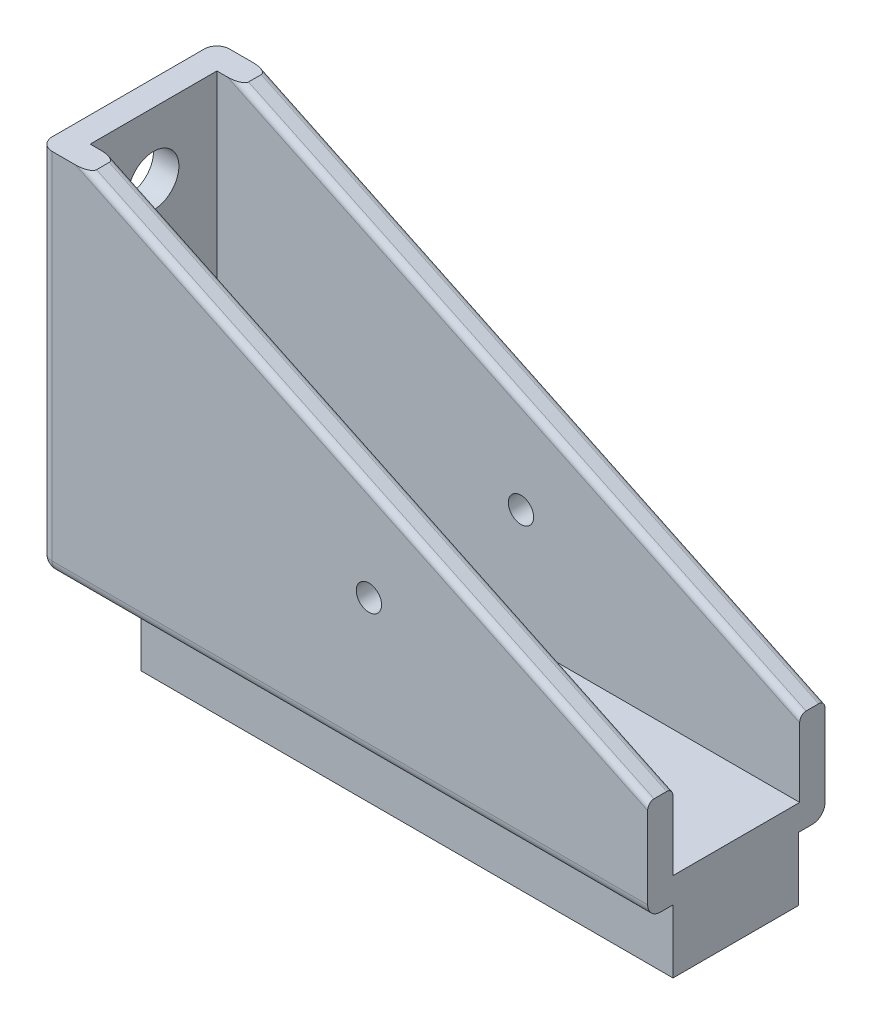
ISO-10303-21;
HEADER;
FILE_DESCRIPTION(('STEP AP214'),'2;1');
FILE_NAME('part.step','',(''),(''),'','','');
FILE_SCHEMA(('AUTOMOTIVE_DESIGN { 1 0 10303 214 1 1 1 1 }'));
ENDSEC;
DATA;
#1=APPLICATION_CONTEXT('core data for automotive mechanical design processes');
#2=APPLICATION_PROTOCOL_DEFINITION('international standard','automotive_design',2000,#1);
#3=PRODUCT_CONTEXT('',#1,'mechanical');
#4=PRODUCT('Part','Part','',(#3));
#5=PRODUCT_RELATED_PRODUCT_CATEGORY('part','',(#4));
#6=PRODUCT_DEFINITION_FORMATION('','',#4);
#7=PRODUCT_DEFINITION_CONTEXT('part definition',#1,'design');
#8=PRODUCT_DEFINITION('design','',#6,#7);
#9=PRODUCT_DEFINITION_SHAPE('','',#8);
#10=(LENGTH_UNIT() NAMED_UNIT(*) SI_UNIT(.MILLI.,.METRE.));
#11=(NAMED_UNIT(*) PLANE_ANGLE_UNIT() SI_UNIT($,.RADIAN.));
#12=(NAMED_UNIT(*) SI_UNIT($,.STERADIAN.) SOLID_ANGLE_UNIT());
#13=UNCERTAINTY_MEASURE_WITH_UNIT(LENGTH_MEASURE(1.E-05),#10,'distance_accuracy_value','');
#14=(GEOMETRIC_REPRESENTATION_CONTEXT(3) GLOBAL_UNCERTAINTY_ASSIGNED_CONTEXT((#13)) GLOBAL_UNIT_ASSIGNED_CONTEXT((#10,
#11,#12)) REPRESENTATION_CONTEXT('',''));
#15=CARTESIAN_POINT('',(0.,0.,0.));
#16=DIRECTION('',(0.,0.,1.));
#17=DIRECTION('',(1.,0.,0.));
#18=AXIS2_PLACEMENT_3D('',#15,#16,#17);
#19=CARTESIAN_POINT('',(-45.3827683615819,3.08601694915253,-14.));
#20=DIRECTION('',(0.,-1.,0.));
#21=DIRECTION('',(0.,0.,-1.));
#22=AXIS2_PLACEMENT_3D('',#19,#20,#21);
#23=PLANE('',#22);
#24=DIRECTION('',(1.,0.,0.));
#25=VECTOR('',#24,1.);
#26=CARTESIAN_POINT('',(-45.3827683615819,3.08601694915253,-1.));
#27=LINE('',#26,#25);
#28=CARTESIAN_POINT('',(2.61723163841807,3.08601694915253,-0.999999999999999));
#29=VERTEX_POINT('',#28);
#30=CARTESIAN_POINT('',(-44.3827683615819,3.08601694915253,-1.));
#31=VERTEX_POINT('',#30);
#32=EDGE_CURVE('E295',#29,#31,#27,.F.);
#33=ORIENTED_EDGE('',*,*,#32,.T.);
#34=DIRECTION('',(0.,0.,1.));
#35=VECTOR('',#34,1.);
#36=CARTESIAN_POINT('',(-44.3827683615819,3.08601694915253,-14.));
#37=LINE('',#36,#35);
#38=CARTESIAN_POINT('',(-44.3827683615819,3.08601694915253,-13.));
#39=VERTEX_POINT('',#38);
#40=EDGE_CURVE('E359',#31,#39,#37,.F.);
#41=ORIENTED_EDGE('',*,*,#40,.T.);
#42=DIRECTION('',(1.,0.,0.));
#43=VECTOR('',#42,1.);
#44=CARTESIAN_POINT('',(-45.3827683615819,3.08601694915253,-13.));
#45=LINE('',#44,#43);
#46=CARTESIAN_POINT('',(2.61723163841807,3.08601694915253,-13.));
#47=VERTEX_POINT('',#46);
#48=EDGE_CURVE('E297',#39,#47,#45,.T.);
#49=ORIENTED_EDGE('',*,*,#48,.T.);
#50=DIRECTION('',(0.,0.,1.));
#51=VECTOR('',#50,1.);
#52=CARTESIAN_POINT('',(2.61723163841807,3.08601694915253,-14.));
#53=LINE('',#52,#51);
#54=CARTESIAN_POINT('',(2.61723163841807,3.08601694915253,-11.9065683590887));
#55=VERTEX_POINT('',#54);
#56=EDGE_CURVE('E211',#47,#55,#53,.T.);
#57=ORIENTED_EDGE('',*,*,#56,.T.);
#58=DIRECTION('',(1.,0.,0.));
#59=VECTOR('',#58,1.);
#60=CARTESIAN_POINT('',(-39.3827683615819,3.08601694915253,-11.9065683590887));
#61=LINE('',#60,#59);
#62=CARTESIAN_POINT('',(-39.3827683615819,3.08601694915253,-11.9065683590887));
#63=VERTEX_POINT('',#62);
#64=EDGE_CURVE('E208',#63,#55,#61,.T.);
#65=ORIENTED_EDGE('',*,*,#64,.F.);
#66=DIRECTION('',(0.,0.,-1.));
#67=VECTOR('',#66,1.);
#68=CARTESIAN_POINT('',(-39.3827683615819,3.08601694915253,-12.));
#69=LINE('',#68,#67);
#70=CARTESIAN_POINT('',(-39.3827683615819,3.08601694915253,-12.));
#71=VERTEX_POINT('',#70);
#72=EDGE_CURVE('E193',#63,#71,#69,.T.);
#73=ORIENTED_EDGE('',*,*,#72,.T.);
#74=DIRECTION('',(-1.,0.,0.));
#75=VECTOR('',#74,1.);
#76=CARTESIAN_POINT('',(-43.3827683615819,3.08601694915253,-12.));
#77=LINE('',#76,#75);
#78=CARTESIAN_POINT('',(-43.3827683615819,3.08601694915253,-12.));
#79=VERTEX_POINT('',#78);
#80=EDGE_CURVE('E204',#71,#79,#77,.T.);
#81=ORIENTED_EDGE('',*,*,#80,.T.);
#82=DIRECTION('',(0.,0.,1.));
#83=VECTOR('',#82,1.);
#84=CARTESIAN_POINT('',(-43.3827683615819,3.08601694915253,-12.));
#85=LINE('',#84,#83);
#86=CARTESIAN_POINT('',(-43.3827683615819,3.08601694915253,-2.));
#87=VERTEX_POINT('',#86);
#88=EDGE_CURVE('E237',#79,#87,#85,.T.);
#89=ORIENTED_EDGE('',*,*,#88,.T.);
#90=DIRECTION('',(1.,0.,0.));
#91=VECTOR('',#90,1.);
#92=CARTESIAN_POINT('',(-43.3827683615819,3.08601694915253,-2.));
#93=LINE('',#92,#91);
#94=CARTESIAN_POINT('',(-39.3827683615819,3.08601694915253,-2.));
#95=VERTEX_POINT('',#94);
#96=EDGE_CURVE('E205',#87,#95,#93,.T.);
#97=ORIENTED_EDGE('',*,*,#96,.T.);
#98=DIRECTION('',(-1.,0.,0.));
#99=VECTOR('',#98,1.);
#100=CARTESIAN_POINT('',(-39.3827683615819,3.08601694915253,-2.));
#101=LINE('',#100,#99);
#102=CARTESIAN_POINT('',(2.61723163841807,3.08601694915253,-2.));
#103=VERTEX_POINT('',#102);
#104=EDGE_CURVE('E215',#103,#95,#101,.T.);
#105=ORIENTED_EDGE('',*,*,#104,.F.);
#106=EDGE_CURVE('E293',#103,#29,#53,.T.);
#107=ORIENTED_EDGE('',*,*,#106,.T.);
#108=EDGE_LOOP('',(#33,#41,#49,#57,#65,#73,#81,#89,#97,#105,#107));
#109=FACE_BOUND('',#108,.T.);
#110=ADVANCED_FACE('F34',(#109),#23,.T.);
#111=CARTESIAN_POINT('',(2.61723163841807,11.0860169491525,-14.));
#112=DIRECTION('',(0.430729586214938,0.90248103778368,0.));
#113=DIRECTION('',(-0.90248103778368,0.430729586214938,0.));
#114=AXIS2_PLACEMENT_3D('',#111,#112,#113);
#115=PLANE('',#114);
#116=DIRECTION('',(0.,0.,1.));
#117=VECTOR('',#116,1.);
#118=CARTESIAN_POINT('',(2.61723163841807,11.0860169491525,-14.));
#119=LINE('',#118,#117);
#120=CARTESIAN_POINT('',(2.61723163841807,11.0860169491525,-13.5));
#121=VERTEX_POINT('',#120);
#122=CARTESIAN_POINT('',(2.61723163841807,11.0860169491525,-12.5));
#123=VERTEX_POINT('',#122);
#124=EDGE_CURVE('E288',#121,#123,#119,.T.);
#125=ORIENTED_EDGE('',*,*,#124,.F.);
#126=DIRECTION('',(-0.90248103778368,0.430729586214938,0.));
#127=VECTOR('',#126,1.);
#128=CARTESIAN_POINT('',(2.61723163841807,11.0860169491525,-13.5));
#129=LINE('',#128,#127);
#130=CARTESIAN_POINT('',(-41.3827683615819,32.0860169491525,-13.5));
#131=VERTEX_POINT('',#130);
#132=EDGE_CURVE('E310',#121,#131,#129,.T.);
#133=ORIENTED_EDGE('',*,*,#132,.T.);
#134=DIRECTION('',(0.,0.,1.));
#135=VECTOR('',#134,1.);
#136=CARTESIAN_POINT('',(-41.3827683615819,32.0860169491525,-14.));
#137=LINE('',#136,#135);
#138=CARTESIAN_POINT('',(-41.3827683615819,32.0860169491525,-12.5));
#139=VERTEX_POINT('',#138);
#140=EDGE_CURVE('E287',#131,#139,#137,.T.);
#141=ORIENTED_EDGE('',*,*,#140,.T.);
#142=DIRECTION('',(-0.90248103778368,0.430729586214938,0.));
#143=VECTOR('',#142,1.);
#144=CARTESIAN_POINT('',(2.61723163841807,11.0860169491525,-12.5));
#145=LINE('',#144,#143);
#146=EDGE_CURVE('E308',#139,#123,#145,.F.);
#147=ORIENTED_EDGE('',*,*,#146,.T.);
#148=EDGE_LOOP('',(#125,#133,#141,#147));
#149=FACE_BOUND('',#148,.T.);
#150=ADVANCED_FACE('F453',(#149),#115,.T.);
#151=CARTESIAN_POINT('',(-41.3827683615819,32.0860169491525,-14.));
#152=DIRECTION('',(0.,1.,0.));
#153=DIRECTION('',(0.,0.,1.));
#154=AXIS2_PLACEMENT_3D('',#151,#152,#153);
#155=PLANE('',#154);
#156=DIRECTION('',(0.,0.,1.));
#157=VECTOR('',#156,1.);
#158=CARTESIAN_POINT('',(-45.3827683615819,32.0860169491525,-14.));
#159=LINE('',#158,#157);
#160=CARTESIAN_POINT('',(-45.3827683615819,32.0860169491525,-13.));
#161=VERTEX_POINT('',#160);
#162=CARTESIAN_POINT('',(-45.3827683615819,32.0860169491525,-0.999999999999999));
#163=VERTEX_POINT('',#162);
#164=EDGE_CURVE('E283',#161,#163,#159,.T.);
#165=ORIENTED_EDGE('',*,*,#164,.T.);
#166=CARTESIAN_POINT('',(-44.3827683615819,32.0860169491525,-1.));
#167=DIRECTION('',(0.,1.,0.));
#168=DIRECTION('',(0.,0.,1.));
#169=AXIS2_PLACEMENT_3D('',#166,#167,#168);
#170=CIRCLE('',#169,1.);
#171=CARTESIAN_POINT('',(-44.3827683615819,32.0860169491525,0.));
#172=VERTEX_POINT('',#171);
#173=EDGE_CURVE('E42',#163,#172,#170,.T.);
#174=ORIENTED_EDGE('',*,*,#173,.T.);
#175=DIRECTION('',(-1.,0.,0.));
#176=VECTOR('',#175,1.);
#177=CARTESIAN_POINT('',(-41.3827683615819,32.0860169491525,0.));
#178=LINE('',#177,#176);
#179=CARTESIAN_POINT('',(-42.5435894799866,32.0860169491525,0.));
#180=VERTEX_POINT('',#179);
#181=EDGE_CURVE('E266',#180,#172,#178,.T.);
#182=ORIENTED_EDGE('',*,*,#181,.F.);
#183=CARTESIAN_POINT('',(-42.5435894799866,32.0860169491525,-0.5));
#184=DIRECTION('',(0.,1.,0.));
#185=DIRECTION('',(1.,0.,0.));
#186=AXIS2_PLACEMENT_3D('',#183,#184,#185);
#187=ELLIPSE('',#186,1.16082111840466,0.5);
#188=CARTESIAN_POINT('',(-41.3827683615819,32.0860169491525,-0.5));
#189=VERTEX_POINT('',#188);
#190=EDGE_CURVE('E313',#180,#189,#187,.T.);
#191=ORIENTED_EDGE('',*,*,#190,.T.);
#192=CARTESIAN_POINT('',(-41.3827683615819,32.0860169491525,-1.5));
#193=VERTEX_POINT('',#192);
#194=EDGE_CURVE('E284',#193,#189,#137,.T.);
#195=ORIENTED_EDGE('',*,*,#194,.F.);
#196=CARTESIAN_POINT('',(-42.5435894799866,32.0860169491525,-1.5));
#197=DIRECTION('',(0.,1.,0.));
#198=DIRECTION('',(-1.,0.,0.));
#199=AXIS2_PLACEMENT_3D('',#196,#197,#198);
#200=ELLIPSE('',#199,1.16082111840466,0.5);
#201=CARTESIAN_POINT('',(-42.5435894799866,32.0860169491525,-2.));
#202=VERTEX_POINT('',#201);
#203=EDGE_CURVE('E315',#193,#202,#200,.T.);
#204=ORIENTED_EDGE('',*,*,#203,.T.);
#205=DIRECTION('',(1.,0.,0.));
#206=VECTOR('',#205,1.);
#207=CARTESIAN_POINT('',(-43.3827683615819,32.0860169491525,-2.));
#208=LINE('',#207,#206);
#209=CARTESIAN_POINT('',(-43.3827683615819,32.0860169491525,-2.));
#210=VERTEX_POINT('',#209);
#211=EDGE_CURVE('E251',#210,#202,#208,.T.);
#212=ORIENTED_EDGE('',*,*,#211,.F.);
#213=DIRECTION('',(0.,0.,1.));
#214=VECTOR('',#213,1.);
#215=CARTESIAN_POINT('',(-43.3827683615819,32.0860169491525,-2.));
#216=LINE('',#215,#214);
#217=CARTESIAN_POINT('',(-43.3827683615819,32.0860169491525,-12.));
#218=VERTEX_POINT('',#217);
#219=EDGE_CURVE('E248',#218,#210,#216,.T.);
#220=ORIENTED_EDGE('',*,*,#219,.F.);
#221=DIRECTION('',(-1.,0.,0.));
#222=VECTOR('',#221,1.);
#223=CARTESIAN_POINT('',(-43.3827683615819,32.0860169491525,-12.));
#224=LINE('',#223,#222);
#225=CARTESIAN_POINT('',(-42.5435894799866,32.0860169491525,-12.));
#226=VERTEX_POINT('',#225);
#227=EDGE_CURVE('E245',#226,#218,#224,.T.);
#228=ORIENTED_EDGE('',*,*,#227,.F.);
#229=CARTESIAN_POINT('',(-42.5435894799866,32.0860169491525,-12.5));
#230=DIRECTION('',(0.,1.,0.));
#231=DIRECTION('',(1.,0.,0.));
#232=AXIS2_PLACEMENT_3D('',#229,#230,#231);
#233=ELLIPSE('',#232,1.16082111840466,0.5);
#234=EDGE_CURVE('E317',#226,#139,#233,.T.);
#235=ORIENTED_EDGE('',*,*,#234,.T.);
#236=ORIENTED_EDGE('',*,*,#140,.F.);
#237=CARTESIAN_POINT('',(-42.5435894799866,32.0860169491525,-13.5));
#238=DIRECTION('',(0.,1.,0.));
#239=DIRECTION('',(-1.,0.,0.));
#240=AXIS2_PLACEMENT_3D('',#237,#238,#239);
#241=ELLIPSE('',#240,1.16082111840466,0.5);
#242=CARTESIAN_POINT('',(-42.5435894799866,32.0860169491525,-14.));
#243=VERTEX_POINT('',#242);
#244=EDGE_CURVE('E319',#131,#243,#241,.T.);
#245=ORIENTED_EDGE('',*,*,#244,.T.);
#246=DIRECTION('',(-1.,0.,0.));
#247=VECTOR('',#246,1.);
#248=CARTESIAN_POINT('',(-41.3827683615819,32.0860169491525,-14.));
#249=LINE('',#248,#247);
#250=CARTESIAN_POINT('',(-44.3827683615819,32.0860169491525,-14.));
#251=VERTEX_POINT('',#250);
#252=EDGE_CURVE('E278',#243,#251,#249,.T.);
#253=ORIENTED_EDGE('',*,*,#252,.T.);
#254=CARTESIAN_POINT('',(-44.3827683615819,32.0860169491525,-13.));
#255=DIRECTION('',(0.,1.,0.));
#256=DIRECTION('',(0.,0.,1.));
#257=AXIS2_PLACEMENT_3D('',#254,#255,#256);
#258=CIRCLE('',#257,1.);
#259=EDGE_CURVE('E367',#251,#161,#258,.T.);
#260=ORIENTED_EDGE('',*,*,#259,.T.);
#261=EDGE_LOOP('',(#165,#174,#182,#191,#195,#204,#212,#220,#228,#235,#236,#245,#253,#260));
#262=FACE_BOUND('',#261,.T.);
#263=ADVANCED_FACE('F36',(#262),#155,.T.);
#264=CARTESIAN_POINT('',(2.61723163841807,11.0860169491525,-1.5));
#265=VERTEX_POINT('',#264);
#266=CARTESIAN_POINT('',(2.61723163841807,11.0860169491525,-0.5));
#267=VERTEX_POINT('',#266);
#268=EDGE_CURVE('E289',#265,#267,#119,.T.);
#269=ORIENTED_EDGE('',*,*,#268,.F.);
#270=DIRECTION('',(0.90248103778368,-0.430729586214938,0.));
#271=VECTOR('',#270,1.);
#272=CARTESIAN_POINT('',(-41.3827683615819,32.0860169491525,-1.5));
#273=LINE('',#272,#271);
#274=EDGE_CURVE('E339',#265,#193,#273,.F.);
#275=ORIENTED_EDGE('',*,*,#274,.T.);
#276=ORIENTED_EDGE('',*,*,#194,.T.);
#277=DIRECTION('',(-0.90248103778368,0.430729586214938,0.));
#278=VECTOR('',#277,1.);
#279=CARTESIAN_POINT('',(2.61723163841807,11.0860169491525,-0.5));
#280=LINE('',#279,#278);
#281=EDGE_CURVE('E337',#189,#267,#280,.F.);
#282=ORIENTED_EDGE('',*,*,#281,.T.);
#283=EDGE_LOOP('',(#269,#275,#276,#282));
#284=FACE_BOUND('',#283,.T.);
#285=ADVANCED_FACE('F425',(#284),#115,.T.);
#286=CARTESIAN_POINT('',(2.61723163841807,3.08601694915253,-14.));
#287=DIRECTION('',(1.,0.,0.));
#288=DIRECTION('',(0.,0.,-1.));
#289=AXIS2_PLACEMENT_3D('',#286,#287,#288);
#290=PLANE('',#289);
#291=DIRECTION('',(0.,1.,0.));
#292=VECTOR('',#291,1.);
#293=CARTESIAN_POINT('',(2.61723163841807,3.08601694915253,-14.));
#294=LINE('',#293,#292);
#295=CARTESIAN_POINT('',(2.61723163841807,4.08601694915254,-14.));
#296=VERTEX_POINT('',#295);
#297=CARTESIAN_POINT('',(2.61723163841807,10.5319886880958,-14.));
#298=VERTEX_POINT('',#297);
#299=EDGE_CURVE('E280',#296,#298,#294,.T.);
#300=ORIENTED_EDGE('',*,*,#299,.T.);
#301=CARTESIAN_POINT('',(2.61723163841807,10.5319886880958,-13.5));
#302=DIRECTION('',(1.,0.,0.));
#303=DIRECTION('',(0.,1.,0.));
#304=AXIS2_PLACEMENT_3D('',#301,#302,#303);
#305=ELLIPSE('',#304,0.554028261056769,0.5);
#306=EDGE_CURVE('E329',#298,#121,#305,.T.);
#307=ORIENTED_EDGE('',*,*,#306,.T.);
#308=ORIENTED_EDGE('',*,*,#124,.T.);
#309=CARTESIAN_POINT('',(2.61723163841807,10.5319886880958,-12.5));
#310=DIRECTION('',(1.,0.,0.));
#311=DIRECTION('',(0.,-1.,0.));
#312=AXIS2_PLACEMENT_3D('',#309,#310,#311);
#313=ELLIPSE('',#312,0.554028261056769,0.5);
#314=CARTESIAN_POINT('',(2.61723163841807,10.5319886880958,-12.));
#315=VERTEX_POINT('',#314);
#316=EDGE_CURVE('E327',#123,#315,#313,.T.);
#317=ORIENTED_EDGE('',*,*,#316,.T.);
#318=DIRECTION('',(0.,1.,0.));
#319=VECTOR('',#318,1.);
#320=CARTESIAN_POINT('',(2.61723163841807,5.08601694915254,-12.));
#321=LINE('',#320,#319);
#322=CARTESIAN_POINT('',(2.61723163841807,5.08601694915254,-12.));
#323=VERTEX_POINT('',#322);
#324=EDGE_CURVE('E263',#323,#315,#321,.T.);
#325=ORIENTED_EDGE('',*,*,#324,.F.);
#326=DIRECTION('',(0.,0.,-1.));
#327=VECTOR('',#326,1.);
#328=CARTESIAN_POINT('',(2.61723163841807,5.08601694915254,-2.00000000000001));
#329=LINE('',#328,#327);
#330=CARTESIAN_POINT('',(2.61723163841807,5.08601694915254,-2.));
#331=VERTEX_POINT('',#330);
#332=EDGE_CURVE('E259',#331,#323,#329,.T.);
#333=ORIENTED_EDGE('',*,*,#332,.F.);
#334=DIRECTION('',(0.,1.,0.));
#335=VECTOR('',#334,1.);
#336=CARTESIAN_POINT('',(2.61723163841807,5.08601694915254,-2.00000000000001));
#337=LINE('',#336,#335);
#338=CARTESIAN_POINT('',(2.61723163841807,10.5319886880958,-2.00000000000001));
#339=VERTEX_POINT('',#338);
#340=EDGE_CURVE('E267',#331,#339,#337,.T.);
#341=ORIENTED_EDGE('',*,*,#340,.T.);
#342=CARTESIAN_POINT('',(2.61723163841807,10.5319886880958,-1.50000000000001));
#343=DIRECTION('',(1.,0.,0.));
#344=DIRECTION('',(0.,1.,0.));
#345=AXIS2_PLACEMENT_3D('',#342,#343,#344);
#346=ELLIPSE('',#345,0.554028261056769,0.5);
#347=EDGE_CURVE('E325',#339,#265,#346,.T.);
#348=ORIENTED_EDGE('',*,*,#347,.T.);
#349=ORIENTED_EDGE('',*,*,#268,.T.);
#350=CARTESIAN_POINT('',(2.61723163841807,10.5319886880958,-0.5));
#351=DIRECTION('',(1.,0.,0.));
#352=DIRECTION('',(0.,-1.,0.));
#353=AXIS2_PLACEMENT_3D('',#350,#351,#352);
#354=ELLIPSE('',#353,0.554028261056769,0.5);
#355=CARTESIAN_POINT('',(2.61723163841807,10.5319886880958,0.));
#356=VERTEX_POINT('',#355);
#357=EDGE_CURVE('E323',#267,#356,#354,.T.);
#358=ORIENTED_EDGE('',*,*,#357,.T.);
#359=DIRECTION('',(0.,1.,0.));
#360=VECTOR('',#359,1.);
#361=CARTESIAN_POINT('',(2.61723163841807,3.08601694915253,0.));
#362=LINE('',#361,#360);
#363=CARTESIAN_POINT('',(2.61723163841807,4.08601694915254,0.));
#364=VERTEX_POINT('',#363);
#365=EDGE_CURVE('E275',#364,#356,#362,.T.);
#366=ORIENTED_EDGE('',*,*,#365,.F.);
#367=CARTESIAN_POINT('',(2.61723163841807,4.08601694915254,-1.));
#368=DIRECTION('',(1.,0.,0.));
#369=DIRECTION('',(0.,0.,-1.));
#370=AXIS2_PLACEMENT_3D('',#367,#368,#369);
#371=CIRCLE('',#370,1.);
#372=EDGE_CURVE('E299',#364,#29,#371,.T.);
#373=ORIENTED_EDGE('',*,*,#372,.T.);
#374=ORIENTED_EDGE('',*,*,#106,.F.);
#375=DIRECTION('',(0.,1.,0.));
#376=VECTOR('',#375,1.);
#377=CARTESIAN_POINT('',(2.61723163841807,-1.91398305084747,-2.));
#378=LINE('',#377,#376);
#379=CARTESIAN_POINT('',(2.61723163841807,-1.91398305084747,-2.));
#380=VERTEX_POINT('',#379);
#381=EDGE_CURVE('E227',#380,#103,#378,.T.);
#382=ORIENTED_EDGE('',*,*,#381,.F.);
#383=DIRECTION('',(0.,0.,1.));
#384=VECTOR('',#383,1.);
#385=CARTESIAN_POINT('',(2.61723163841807,-1.91398305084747,-2.));
#386=LINE('',#385,#384);
#387=CARTESIAN_POINT('',(2.61723163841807,-1.91398305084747,-11.9065683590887));
#388=VERTEX_POINT('',#387);
#389=EDGE_CURVE('E480',#388,#380,#386,.T.);
#390=ORIENTED_EDGE('',*,*,#389,.F.);
#391=DIRECTION('',(0.,1.,0.));
#392=VECTOR('',#391,1.);
#393=CARTESIAN_POINT('',(2.61723163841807,-1.91398305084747,-11.9065683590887));
#394=LINE('',#393,#392);
#395=EDGE_CURVE('E222',#388,#55,#394,.T.);
#396=ORIENTED_EDGE('',*,*,#395,.T.);
#397=ORIENTED_EDGE('',*,*,#56,.F.);
#398=CARTESIAN_POINT('',(2.61723163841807,4.08601694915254,-13.));
#399=DIRECTION('',(1.,0.,0.));
#400=DIRECTION('',(0.,0.,-1.));
#401=AXIS2_PLACEMENT_3D('',#398,#399,#400);
#402=CIRCLE('',#401,1.);
#403=EDGE_CURVE('E302',#47,#296,#402,.T.);
#404=ORIENTED_EDGE('',*,*,#403,.T.);
#405=EDGE_LOOP('',(#300,#307,#308,#317,#325,#333,#341,#348,#349,#358,#366,#373,#374,#382,#390,
#396,#397,#404));
#406=FACE_BOUND('',#405,.T.);
#407=ADVANCED_FACE('F415',(#406),#290,.T.);
#408=CARTESIAN_POINT('',(-45.3827683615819,32.0860169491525,-14.));
#409=DIRECTION('',(-1.,0.,0.));
#410=DIRECTION('',(0.,-1.,0.));
#411=AXIS2_PLACEMENT_3D('',#408,#409,#410);
#412=PLANE('',#411);
#413=CARTESIAN_POINT('',(-45.3827683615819,20.0860169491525,-7.));
#414=DIRECTION('',(-1.,0.,0.));
#415=DIRECTION('',(0.,-1.,0.));
#416=AXIS2_PLACEMENT_3D('',#413,#414,#415);
#417=CIRCLE('',#416,2.);
#418=CARTESIAN_POINT('',(-45.3827683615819,18.0860169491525,-7.));
#419=VERTEX_POINT('',#418);
#420=EDGE_CURVE('E221',#419,#419,#417,.T.);
#421=ORIENTED_EDGE('',*,*,#420,.F.);
#422=EDGE_LOOP('',(#421));
#423=FACE_BOUND('',#422,.T.);
#424=CARTESIAN_POINT('',(-45.3827683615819,27.0860169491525,-7.));
#425=DIRECTION('',(-1.,0.,0.));
#426=DIRECTION('',(0.,-1.,0.));
#427=AXIS2_PLACEMENT_3D('',#424,#425,#426);
#428=CIRCLE('',#427,2.);
#429=CARTESIAN_POINT('',(-45.3827683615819,25.0860169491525,-7.));
#430=VERTEX_POINT('',#429);
#431=EDGE_CURVE('E231',#430,#430,#428,.T.);
#432=ORIENTED_EDGE('',*,*,#431,.F.);
#433=EDGE_LOOP('',(#432));
#434=FACE_BOUND('',#433,.T.);
#435=DIRECTION('',(0.,0.,1.));
#436=VECTOR('',#435,1.);
#437=CARTESIAN_POINT('',(-45.3827683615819,4.08601694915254,-14.));
#438=LINE('',#437,#436);
#439=CARTESIAN_POINT('',(-45.3827683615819,4.08601694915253,-13.));
#440=VERTEX_POINT('',#439);
#441=CARTESIAN_POINT('',(-45.3827683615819,4.08601694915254,-1.));
#442=VERTEX_POINT('',#441);
#443=EDGE_CURVE('E354',#440,#442,#438,.T.);
#444=ORIENTED_EDGE('',*,*,#443,.T.);
#445=DIRECTION('',(0.,-1.,0.));
#446=VECTOR('',#445,1.);
#447=CARTESIAN_POINT('',(-45.3827683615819,32.0860169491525,-1.));
#448=LINE('',#447,#446);
#449=EDGE_CURVE('E357',#442,#163,#448,.F.);
#450=ORIENTED_EDGE('',*,*,#449,.T.);
#451=ORIENTED_EDGE('',*,*,#164,.F.);
#452=DIRECTION('',(0.,-1.,0.));
#453=VECTOR('',#452,1.);
#454=CARTESIAN_POINT('',(-45.3827683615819,32.0860169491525,-13.));
#455=LINE('',#454,#453);
#456=EDGE_CURVE('E344',#161,#440,#455,.T.);
#457=ORIENTED_EDGE('',*,*,#456,.T.);
#458=EDGE_LOOP('',(#444,#450,#451,#457));
#459=FACE_BOUND('',#458,.T.);
#460=ADVANCED_FACE('F373',(#423,#434,#459),#412,.T.);
#461=CARTESIAN_POINT('',(2.61723163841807,32.0860169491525,-14.));
#462=DIRECTION('',(0.,0.,-1.));
#463=DIRECTION('',(-1.,0.,0.));
#464=AXIS2_PLACEMENT_3D('',#461,#462,#463);
#465=PLANE('',#464);
#466=CARTESIAN_POINT('',(-19.3827683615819,14.0860169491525,-14.));
#467=DIRECTION('',(0.,0.,1.));
#468=DIRECTION('',(1.,0.,0.));
#469=AXIS2_PLACEMENT_3D('',#466,#467,#468);
#470=CIRCLE('',#469,1.);
#471=CARTESIAN_POINT('',(-18.3827683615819,14.0860169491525,-14.));
#472=VERTEX_POINT('',#471);
#473=EDGE_CURVE('E352',#472,#472,#470,.T.);
#474=ORIENTED_EDGE('',*,*,#473,.T.);
#475=EDGE_LOOP('',(#474));
#476=FACE_BOUND('',#475,.T.);
#477=DIRECTION('',(1.,0.,0.));
#478=VECTOR('',#477,1.);
#479=CARTESIAN_POINT('',(2.61723163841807,4.08601694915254,-14.));
#480=LINE('',#479,#478);
#481=CARTESIAN_POINT('',(-44.3827683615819,4.08601694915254,-14.));
#482=VERTEX_POINT('',#481);
#483=EDGE_CURVE('E304',#296,#482,#480,.F.);
#484=ORIENTED_EDGE('',*,*,#483,.T.);
#485=DIRECTION('',(0.,-1.,0.));
#486=VECTOR('',#485,1.);
#487=CARTESIAN_POINT('',(-44.3827683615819,32.0860169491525,-14.));
#488=LINE('',#487,#486);
#489=EDGE_CURVE('E12',#482,#251,#488,.F.);
#490=ORIENTED_EDGE('',*,*,#489,.T.);
#491=ORIENTED_EDGE('',*,*,#252,.F.);
#492=DIRECTION('',(-0.90248103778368,0.430729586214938,0.));
#493=VECTOR('',#492,1.);
#494=CARTESIAN_POINT('',(-5.76136411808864,14.5308639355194,-14.));
#495=LINE('',#494,#493);
#496=EDGE_CURVE('E321',#243,#298,#495,.F.);
#497=ORIENTED_EDGE('',*,*,#496,.T.);
#498=ORIENTED_EDGE('',*,*,#299,.F.);
#499=EDGE_LOOP('',(#484,#490,#491,#497,#498));
#500=FACE_BOUND('',#499,.T.);
#501=ADVANCED_FACE('F460',(#476,#500),#465,.T.);
#502=CARTESIAN_POINT('',(2.61723163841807,32.0860169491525,0.));
#503=DIRECTION('',(0.,0.,-1.));
#504=DIRECTION('',(-1.,0.,0.));
#505=AXIS2_PLACEMENT_3D('',#502,#503,#504);
#506=PLANE('',#505);
#507=CARTESIAN_POINT('',(-19.3827683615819,14.0860169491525,0.));
#508=DIRECTION('',(0.,0.,1.));
#509=DIRECTION('',(1.,0.,0.));
#510=AXIS2_PLACEMENT_3D('',#507,#508,#509);
#511=CIRCLE('',#510,1.);
#512=CARTESIAN_POINT('',(-18.3827683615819,14.0860169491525,0.));
#513=VERTEX_POINT('',#512);
#514=EDGE_CURVE('E382',#513,#513,#511,.T.);
#515=ORIENTED_EDGE('',*,*,#514,.F.);
#516=EDGE_LOOP('',(#515));
#517=FACE_BOUND('',#516,.T.);
#518=ORIENTED_EDGE('',*,*,#181,.T.);
#519=DIRECTION('',(0.,-1.,0.));
#520=VECTOR('',#519,1.);
#521=CARTESIAN_POINT('',(-44.3827683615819,4.08601694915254,0.));
#522=LINE('',#521,#520);
#523=CARTESIAN_POINT('',(-44.3827683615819,4.08601694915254,0.));
#524=VERTEX_POINT('',#523);
#525=EDGE_CURVE('E365',#172,#524,#522,.T.);
#526=ORIENTED_EDGE('',*,*,#525,.T.);
#527=DIRECTION('',(1.,0.,0.));
#528=VECTOR('',#527,1.);
#529=CARTESIAN_POINT('',(2.61723163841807,4.08601694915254,0.));
#530=LINE('',#529,#528);
#531=EDGE_CURVE('E306',#524,#364,#530,.T.);
#532=ORIENTED_EDGE('',*,*,#531,.T.);
#533=ORIENTED_EDGE('',*,*,#365,.T.);
#534=DIRECTION('',(-0.90248103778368,0.430729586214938,0.));
#535=VECTOR('',#534,1.);
#536=CARTESIAN_POINT('',(-41.5981331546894,31.6347764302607,0.));
#537=LINE('',#536,#535);
#538=EDGE_CURVE('E341',#356,#180,#537,.T.);
#539=ORIENTED_EDGE('',*,*,#538,.T.);
#540=EDGE_LOOP('',(#518,#526,#532,#533,#539));
#541=FACE_BOUND('',#540,.T.);
#542=ADVANCED_FACE('F407',(#517,#541),#506,.F.);
#543=CARTESIAN_POINT('',(-45.3827683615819,4.08601694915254,-13.));
#544=DIRECTION('',(1.,0.,0.));
#545=DIRECTION('',(0.,0.,-1.));
#546=AXIS2_PLACEMENT_3D('',#543,#544,#545);
#547=CYLINDRICAL_SURFACE('',#546,1.);
#548=ORIENTED_EDGE('',*,*,#48,.F.);
#549=CARTESIAN_POINT('',(-44.3827683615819,4.08601694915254,-13.));
#550=DIRECTION('',(1.,0.,0.));
#551=DIRECTION('',(0.,0.,-1.));
#552=AXIS2_PLACEMENT_3D('',#549,#550,#551);
#553=CIRCLE('',#552,1.);
#554=EDGE_CURVE('E363',#39,#482,#553,.T.);
#555=ORIENTED_EDGE('',*,*,#554,.T.);
#556=ORIENTED_EDGE('',*,*,#483,.F.);
#557=ORIENTED_EDGE('',*,*,#403,.F.);
#558=EDGE_LOOP('',(#548,#555,#556,#557));
#559=FACE_BOUND('',#558,.T.);
#560=ADVANCED_FACE('F465',(#559),#547,.T.);
#561=CARTESIAN_POINT('',(2.61723163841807,4.08601694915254,-1.));
#562=DIRECTION('',(-1.,0.,0.));
#563=DIRECTION('',(0.,0.,1.));
#564=AXIS2_PLACEMENT_3D('',#561,#562,#563);
#565=CYLINDRICAL_SURFACE('',#564,1.);
#566=ORIENTED_EDGE('',*,*,#531,.F.);
#567=CARTESIAN_POINT('',(-44.3827683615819,4.08601694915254,-1.));
#568=DIRECTION('',(-1.,0.,0.));
#569=DIRECTION('',(0.,0.,1.));
#570=AXIS2_PLACEMENT_3D('',#567,#568,#569);
#571=CIRCLE('',#570,1.);
#572=EDGE_CURVE('E361',#524,#31,#571,.F.);
#573=ORIENTED_EDGE('',*,*,#572,.T.);
#574=ORIENTED_EDGE('',*,*,#32,.F.);
#575=ORIENTED_EDGE('',*,*,#372,.F.);
#576=EDGE_LOOP('',(#566,#573,#574,#575));
#577=FACE_BOUND('',#576,.T.);
#578=ADVANCED_FACE('F410',(#577),#565,.T.);
#579=CARTESIAN_POINT('',(-43.3827683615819,5.08601694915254,-12.));
#580=DIRECTION('',(0.,0.,-1.));
#581=DIRECTION('',(-1.,0.,0.));
#582=AXIS2_PLACEMENT_3D('',#579,#580,#581);
#583=PLANE('',#582);
#584=CARTESIAN_POINT('',(-19.3827683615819,14.0860169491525,-12.));
#585=DIRECTION('',(0.,0.,-1.));
#586=DIRECTION('',(-1.,0.,0.));
#587=AXIS2_PLACEMENT_3D('',#584,#585,#586);
#588=CIRCLE('',#587,1.);
#589=CARTESIAN_POINT('',(-20.3827683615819,14.0860169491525,-12.));
#590=VERTEX_POINT('',#589);
#591=EDGE_CURVE('E216',#590,#590,#588,.T.);
#592=ORIENTED_EDGE('',*,*,#591,.T.);
#593=EDGE_LOOP('',(#592));
#594=FACE_BOUND('',#593,.T.);
#595=ORIENTED_EDGE('',*,*,#324,.T.);
#596=DIRECTION('',(-0.90248103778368,0.430729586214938,0.));
#597=VECTOR('',#596,1.);
#598=CARTESIAN_POINT('',(-41.5981331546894,31.6347764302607,-12.));
#599=LINE('',#598,#597);
#600=EDGE_CURVE('E331',#315,#226,#599,.T.);
#601=ORIENTED_EDGE('',*,*,#600,.T.);
#602=ORIENTED_EDGE('',*,*,#227,.T.);
#603=DIRECTION('',(0.,1.,0.));
#604=VECTOR('',#603,1.);
#605=CARTESIAN_POINT('',(-43.3827683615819,5.08601694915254,-12.));
#606=LINE('',#605,#604);
#607=EDGE_CURVE('E262',#79,#218,#606,.T.);
#608=ORIENTED_EDGE('',*,*,#607,.F.);
#609=ORIENTED_EDGE('',*,*,#80,.F.);
#610=DIRECTION('',(0.,1.,0.));
#611=VECTOR('',#610,1.);
#612=CARTESIAN_POINT('',(-39.3827683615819,3.08601694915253,-12.));
#613=LINE('',#612,#611);
#614=CARTESIAN_POINT('',(-39.3827683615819,5.08601694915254,-12.));
#615=VERTEX_POINT('',#614);
#616=EDGE_CURVE('E200',#71,#615,#613,.T.);
#617=ORIENTED_EDGE('',*,*,#616,.T.);
#618=DIRECTION('',(-1.,0.,0.));
#619=VECTOR('',#618,1.);
#620=CARTESIAN_POINT('',(-43.3827683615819,5.08601694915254,-12.));
#621=LINE('',#620,#619);
#622=EDGE_CURVE('E254',#323,#615,#621,.T.);
#623=ORIENTED_EDGE('',*,*,#622,.F.);
#624=EDGE_LOOP('',(#595,#601,#602,#608,#609,#617,#623));
#625=FACE_BOUND('',#624,.T.);
#626=ADVANCED_FACE('F443',(#594,#625),#583,.F.);
#627=CARTESIAN_POINT('',(-43.3827683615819,5.08601694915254,-2.));
#628=DIRECTION('',(0.,0.,1.));
#629=DIRECTION('',(1.,0.,0.));
#630=AXIS2_PLACEMENT_3D('',#627,#628,#629);
#631=PLANE('',#630);
#632=CARTESIAN_POINT('',(-19.3827683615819,14.0860169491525,-2.));
#633=DIRECTION('',(0.,0.,1.));
#634=DIRECTION('',(1.,0.,0.));
#635=AXIS2_PLACEMENT_3D('',#632,#633,#634);
#636=CIRCLE('',#635,1.);
#637=CARTESIAN_POINT('',(-18.3827683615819,14.0860169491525,-2.));
#638=VERTEX_POINT('',#637);
#639=EDGE_CURVE('E349',#638,#638,#636,.T.);
#640=ORIENTED_EDGE('',*,*,#639,.T.);
#641=EDGE_LOOP('',(#640));
#642=FACE_BOUND('',#641,.T.);
#643=ORIENTED_EDGE('',*,*,#211,.T.);
#644=DIRECTION('',(0.90248103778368,-0.430729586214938,0.));
#645=VECTOR('',#644,1.);
#646=CARTESIAN_POINT('',(2.4018668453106,10.6347764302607,-2.00000000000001));
#647=LINE('',#646,#645);
#648=EDGE_CURVE('E334',#202,#339,#647,.T.);
#649=ORIENTED_EDGE('',*,*,#648,.T.);
#650=ORIENTED_EDGE('',*,*,#340,.F.);
#651=DIRECTION('',(1.,0.,0.));
#652=VECTOR('',#651,1.);
#653=CARTESIAN_POINT('',(-43.3827683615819,5.08601694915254,-2.));
#654=LINE('',#653,#652);
#655=CARTESIAN_POINT('',(-39.3827683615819,5.08601694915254,-2.));
#656=VERTEX_POINT('',#655);
#657=EDGE_CURVE('E257',#656,#331,#654,.T.);
#658=ORIENTED_EDGE('',*,*,#657,.F.);
#659=DIRECTION('',(0.,1.,0.));
#660=VECTOR('',#659,1.);
#661=CARTESIAN_POINT('',(-39.3827683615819,3.08601694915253,-2.));
#662=LINE('',#661,#660);
#663=EDGE_CURVE('E243',#95,#656,#662,.T.);
#664=ORIENTED_EDGE('',*,*,#663,.F.);
#665=ORIENTED_EDGE('',*,*,#96,.F.);
#666=DIRECTION('',(0.,1.,0.));
#667=VECTOR('',#666,1.);
#668=CARTESIAN_POINT('',(-43.3827683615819,5.08601694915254,-2.));
#669=LINE('',#668,#667);
#670=EDGE_CURVE('E270',#87,#210,#669,.T.);
#671=ORIENTED_EDGE('',*,*,#670,.T.);
#672=EDGE_LOOP('',(#643,#649,#650,#658,#664,#665,#671));
#673=FACE_BOUND('',#672,.T.);
#674=ADVANCED_FACE('F433',(#642,#673),#631,.F.);
#675=CARTESIAN_POINT('',(-43.3827683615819,5.08601694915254,-2.));
#676=DIRECTION('',(-1.,0.,0.));
#677=DIRECTION('',(0.,0.,1.));
#678=AXIS2_PLACEMENT_3D('',#675,#676,#677);
#679=PLANE('',#678);
#680=CARTESIAN_POINT('',(-43.3827683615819,20.0860169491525,-7.));
#681=DIRECTION('',(-1.,0.,0.));
#682=DIRECTION('',(0.,0.,1.));
#683=AXIS2_PLACEMENT_3D('',#680,#681,#682);
#684=CIRCLE('',#683,2.);
#685=CARTESIAN_POINT('',(-43.3827683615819,20.0860169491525,-5.));
#686=VERTEX_POINT('',#685);
#687=EDGE_CURVE('E225',#686,#686,#684,.T.);
#688=ORIENTED_EDGE('',*,*,#687,.T.);
#689=EDGE_LOOP('',(#688));
#690=FACE_BOUND('',#689,.T.);
#691=CARTESIAN_POINT('',(-43.3827683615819,27.0860169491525,-7.));
#692=DIRECTION('',(-1.,0.,0.));
#693=DIRECTION('',(0.,0.,1.));
#694=AXIS2_PLACEMENT_3D('',#691,#692,#693);
#695=CIRCLE('',#694,2.);
#696=CARTESIAN_POINT('',(-43.3827683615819,27.0860169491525,-5.));
#697=VERTEX_POINT('',#696);
#698=EDGE_CURVE('E234',#697,#697,#695,.T.);
#699=ORIENTED_EDGE('',*,*,#698,.T.);
#700=EDGE_LOOP('',(#699));
#701=FACE_BOUND('',#700,.T.);
#702=ORIENTED_EDGE('',*,*,#219,.T.);
#703=ORIENTED_EDGE('',*,*,#670,.F.);
#704=ORIENTED_EDGE('',*,*,#88,.F.);
#705=ORIENTED_EDGE('',*,*,#607,.T.);
#706=EDGE_LOOP('',(#702,#703,#704,#705));
#707=FACE_BOUND('',#706,.T.);
#708=ADVANCED_FACE('F438',(#690,#701,#707),#679,.F.);
#709=CARTESIAN_POINT('',(2.61723163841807,5.08601694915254,-12.));
#710=DIRECTION('',(0.,1.,0.));
#711=DIRECTION('',(0.,0.,1.));
#712=AXIS2_PLACEMENT_3D('',#709,#710,#711);
#713=PLANE('',#712);
#714=DIRECTION('',(0.,0.,-1.));
#715=VECTOR('',#714,1.);
#716=CARTESIAN_POINT('',(-39.3827683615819,5.08601694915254,-12.));
#717=LINE('',#716,#715);
#718=EDGE_CURVE('E235',#656,#615,#717,.T.);
#719=ORIENTED_EDGE('',*,*,#718,.F.);
#720=ORIENTED_EDGE('',*,*,#657,.T.);
#721=ORIENTED_EDGE('',*,*,#332,.T.);
#722=ORIENTED_EDGE('',*,*,#622,.T.);
#723=EDGE_LOOP('',(#719,#720,#721,#722));
#724=FACE_BOUND('',#723,.T.);
#725=ADVANCED_FACE('F529',(#724),#713,.T.);
#726=CARTESIAN_POINT('',(-39.3827683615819,3.08601694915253,-12.));
#727=DIRECTION('',(1.,0.,0.));
#728=DIRECTION('',(0.,0.,-1.));
#729=AXIS2_PLACEMENT_3D('',#726,#727,#728);
#730=PLANE('',#729);
#731=ORIENTED_EDGE('',*,*,#718,.T.);
#732=ORIENTED_EDGE('',*,*,#616,.F.);
#733=ORIENTED_EDGE('',*,*,#72,.F.);
#734=DIRECTION('',(0.,1.,0.));
#735=VECTOR('',#734,1.);
#736=CARTESIAN_POINT('',(-39.3827683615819,-1.91398305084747,-11.9065683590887));
#737=LINE('',#736,#735);
#738=CARTESIAN_POINT('',(-39.3827683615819,-1.91398305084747,-11.9065683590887));
#739=VERTEX_POINT('',#738);
#740=EDGE_CURVE('E199',#739,#63,#737,.T.);
#741=ORIENTED_EDGE('',*,*,#740,.F.);
#742=DIRECTION('',(0.,0.,-1.));
#743=VECTOR('',#742,1.);
#744=CARTESIAN_POINT('',(-39.3827683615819,-1.91398305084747,-2.));
#745=LINE('',#744,#743);
#746=CARTESIAN_POINT('',(-39.3827683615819,-1.91398305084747,-2.));
#747=VERTEX_POINT('',#746);
#748=EDGE_CURVE('E483',#747,#739,#745,.T.);
#749=ORIENTED_EDGE('',*,*,#748,.F.);
#750=DIRECTION('',(0.,1.,0.));
#751=VECTOR('',#750,1.);
#752=CARTESIAN_POINT('',(-39.3827683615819,-1.91398305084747,-2.));
#753=LINE('',#752,#751);
#754=EDGE_CURVE('E476',#747,#95,#753,.T.);
#755=ORIENTED_EDGE('',*,*,#754,.T.);
#756=ORIENTED_EDGE('',*,*,#663,.T.);
#757=EDGE_LOOP('',(#731,#732,#733,#741,#749,#755,#756));
#758=FACE_BOUND('',#757,.T.);
#759=ADVANCED_FACE('F196',(#758),#730,.F.);
#760=CARTESIAN_POINT('',(2.4018668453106,10.6347764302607,-13.5));
#761=DIRECTION('',(-0.90248103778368,0.430729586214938,0.));
#762=DIRECTION('',(-0.430729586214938,-0.90248103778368,0.));
#763=AXIS2_PLACEMENT_3D('',#760,#761,#762);
#764=CYLINDRICAL_SURFACE('',#763,0.5);
#765=ORIENTED_EDGE('',*,*,#306,.F.);
#766=ORIENTED_EDGE('',*,*,#496,.F.);
#767=ORIENTED_EDGE('',*,*,#244,.F.);
#768=ORIENTED_EDGE('',*,*,#132,.F.);
#769=EDGE_LOOP('',(#765,#766,#767,#768));
#770=FACE_BOUND('',#769,.T.);
#771=ADVANCED_FACE('F459',(#770),#764,.T.);
#772=CARTESIAN_POINT('',(-32.73149453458,27.4029716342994,-12.5));
#773=DIRECTION('',(0.90248103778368,-0.430729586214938,0.));
#774=DIRECTION('',(0.430729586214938,0.90248103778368,0.));
#775=AXIS2_PLACEMENT_3D('',#772,#773,#774);
#776=CYLINDRICAL_SURFACE('',#775,0.5);
#777=ORIENTED_EDGE('',*,*,#316,.F.);
#778=ORIENTED_EDGE('',*,*,#146,.F.);
#779=ORIENTED_EDGE('',*,*,#234,.F.);
#780=ORIENTED_EDGE('',*,*,#600,.F.);
#781=EDGE_LOOP('',(#777,#778,#779,#780));
#782=FACE_BOUND('',#781,.T.);
#783=ADVANCED_FACE('F448',(#782),#776,.T.);
#784=CARTESIAN_POINT('',(-32.73149453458,27.4029716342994,-1.5));
#785=DIRECTION('',(-0.90248103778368,0.430729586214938,0.));
#786=DIRECTION('',(-0.430729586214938,-0.90248103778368,0.));
#787=AXIS2_PLACEMENT_3D('',#784,#785,#786);
#788=CYLINDRICAL_SURFACE('',#787,0.5);
#789=ORIENTED_EDGE('',*,*,#203,.F.);
#790=ORIENTED_EDGE('',*,*,#274,.F.);
#791=ORIENTED_EDGE('',*,*,#347,.F.);
#792=ORIENTED_EDGE('',*,*,#648,.F.);
#793=EDGE_LOOP('',(#789,#790,#791,#792));
#794=FACE_BOUND('',#793,.T.);
#795=ADVANCED_FACE('F428',(#794),#788,.T.);
#796=CARTESIAN_POINT('',(-5.76136411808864,14.5308639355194,-0.5));
#797=DIRECTION('',(0.90248103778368,-0.430729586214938,0.));
#798=DIRECTION('',(0.430729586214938,0.90248103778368,0.));
#799=AXIS2_PLACEMENT_3D('',#796,#797,#798);
#800=CYLINDRICAL_SURFACE('',#799,0.5);
#801=ORIENTED_EDGE('',*,*,#357,.F.);
#802=ORIENTED_EDGE('',*,*,#281,.F.);
#803=ORIENTED_EDGE('',*,*,#190,.F.);
#804=ORIENTED_EDGE('',*,*,#538,.F.);
#805=EDGE_LOOP('',(#801,#802,#803,#804));
#806=FACE_BOUND('',#805,.T.);
#807=ADVANCED_FACE('F419',(#806),#800,.T.);
#808=CARTESIAN_POINT('',(2.61723163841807,27.0860169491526,-7.));
#809=DIRECTION('',(-1.,0.,0.));
#810=DIRECTION('',(0.,-1.,0.));
#811=AXIS2_PLACEMENT_3D('',#808,#809,#810);
#812=CYLINDRICAL_SURFACE('',#811,2.);
#813=ORIENTED_EDGE('',*,*,#431,.T.);
#814=EDGE_LOOP('',(#813));
#815=FACE_BOUND('',#814,.T.);
#816=ORIENTED_EDGE('',*,*,#698,.F.);
#817=EDGE_LOOP('',(#816));
#818=FACE_BOUND('',#817,.T.);
#819=ADVANCED_FACE('F521',(#815,#818),#812,.F.);
#820=CARTESIAN_POINT('',(2.61723163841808,20.0860169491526,-7.));
#821=DIRECTION('',(-1.,0.,0.));
#822=DIRECTION('',(0.,-1.,0.));
#823=AXIS2_PLACEMENT_3D('',#820,#821,#822);
#824=CYLINDRICAL_SURFACE('',#823,2.);
#825=ORIENTED_EDGE('',*,*,#420,.T.);
#826=EDGE_LOOP('',(#825));
#827=FACE_BOUND('',#826,.T.);
#828=ORIENTED_EDGE('',*,*,#687,.F.);
#829=EDGE_LOOP('',(#828));
#830=FACE_BOUND('',#829,.T.);
#831=ADVANCED_FACE('F524',(#827,#830),#824,.F.);
#832=CARTESIAN_POINT('',(-39.3827683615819,-1.91398305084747,-11.9065683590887));
#833=DIRECTION('',(0.,0.,1.));
#834=DIRECTION('',(1.,0.,0.));
#835=AXIS2_PLACEMENT_3D('',#832,#833,#834);
#836=PLANE('',#835);
#837=ORIENTED_EDGE('',*,*,#64,.T.);
#838=ORIENTED_EDGE('',*,*,#395,.F.);
#839=DIRECTION('',(1.,0.,0.));
#840=VECTOR('',#839,1.);
#841=CARTESIAN_POINT('',(-39.3827683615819,-1.91398305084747,-11.9065683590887));
#842=LINE('',#841,#840);
#843=EDGE_CURVE('E219',#739,#388,#842,.T.);
#844=ORIENTED_EDGE('',*,*,#843,.F.);
#845=ORIENTED_EDGE('',*,*,#740,.T.);
#846=EDGE_LOOP('',(#837,#838,#844,#845));
#847=FACE_BOUND('',#846,.T.);
#848=ADVANCED_FACE('F218',(#847),#836,.F.);
#849=CARTESIAN_POINT('',(-39.3827683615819,-1.91398305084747,-2.));
#850=DIRECTION('',(0.,0.,-1.));
#851=DIRECTION('',(-1.,0.,0.));
#852=AXIS2_PLACEMENT_3D('',#849,#850,#851);
#853=PLANE('',#852);
#854=ORIENTED_EDGE('',*,*,#104,.T.);
#855=ORIENTED_EDGE('',*,*,#754,.F.);
#856=DIRECTION('',(-1.,0.,0.));
#857=VECTOR('',#856,1.);
#858=CARTESIAN_POINT('',(-39.3827683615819,-1.91398305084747,-2.));
#859=LINE('',#858,#857);
#860=EDGE_CURVE('E475',#380,#747,#859,.T.);
#861=ORIENTED_EDGE('',*,*,#860,.F.);
#862=ORIENTED_EDGE('',*,*,#381,.T.);
#863=EDGE_LOOP('',(#854,#855,#861,#862));
#864=FACE_BOUND('',#863,.T.);
#865=ADVANCED_FACE('F472',(#864),#853,.F.);
#866=CARTESIAN_POINT('',(-39.3827683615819,-1.91398305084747,-11.9065683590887));
#867=DIRECTION('',(0.,-1.,0.));
#868=DIRECTION('',(0.,0.,-1.));
#869=AXIS2_PLACEMENT_3D('',#866,#867,#868);
#870=PLANE('',#869);
#871=ORIENTED_EDGE('',*,*,#748,.T.);
#872=ORIENTED_EDGE('',*,*,#843,.T.);
#873=ORIENTED_EDGE('',*,*,#389,.T.);
#874=ORIENTED_EDGE('',*,*,#860,.T.);
#875=EDGE_LOOP('',(#871,#872,#873,#874));
#876=FACE_BOUND('',#875,.T.);
#877=ADVANCED_FACE('F646',(#876),#870,.T.);
#878=CARTESIAN_POINT('',(-19.3827683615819,14.0860169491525,-14.));
#879=DIRECTION('',(0.,0.,1.));
#880=DIRECTION('',(1.,0.,0.));
#881=AXIS2_PLACEMENT_3D('',#878,#879,#880);
#882=CYLINDRICAL_SURFACE('',#881,1.);
#883=ORIENTED_EDGE('',*,*,#514,.T.);
#884=EDGE_LOOP('',(#883));
#885=FACE_BOUND('',#884,.T.);
#886=ORIENTED_EDGE('',*,*,#639,.F.);
#887=EDGE_LOOP('',(#886));
#888=FACE_BOUND('',#887,.T.);
#889=ADVANCED_FACE('F493',(#885,#888),#882,.F.);
#890=ORIENTED_EDGE('',*,*,#473,.F.);
#891=EDGE_LOOP('',(#890));
#892=FACE_BOUND('',#891,.T.);
#893=ORIENTED_EDGE('',*,*,#591,.F.);
#894=EDGE_LOOP('',(#893));
#895=FACE_BOUND('',#894,.T.);
#896=ADVANCED_FACE('F664',(#892,#895),#882,.F.);
#897=CARTESIAN_POINT('',(-44.3827683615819,32.0860169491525,-13.));
#898=DIRECTION('',(0.,-1.,0.));
#899=DIRECTION('',(1.,0.,0.));
#900=AXIS2_PLACEMENT_3D('',#897,#898,#899);
#901=CYLINDRICAL_SURFACE('',#900,1.);
#902=ORIENTED_EDGE('',*,*,#259,.F.);
#903=ORIENTED_EDGE('',*,*,#489,.F.);
#904=CARTESIAN_POINT('',(-44.3827683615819,4.08601694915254,-13.));
#905=DIRECTION('',(0.,-1.,0.));
#906=DIRECTION('',(0.,0.,-1.));
#907=AXIS2_PLACEMENT_3D('',#904,#905,#906);
#908=CIRCLE('',#907,1.);
#909=EDGE_CURVE('E378',#440,#482,#908,.T.);
#910=ORIENTED_EDGE('',*,*,#909,.F.);
#911=ORIENTED_EDGE('',*,*,#456,.F.);
#912=EDGE_LOOP('',(#902,#903,#910,#911));
#913=FACE_BOUND('',#912,.T.);
#914=ADVANCED_FACE('F376',(#913),#901,.T.);
#915=CARTESIAN_POINT('',(-44.3827683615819,32.0860169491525,-1.));
#916=DIRECTION('',(0.,1.,0.));
#917=DIRECTION('',(-1.,0.,0.));
#918=AXIS2_PLACEMENT_3D('',#915,#916,#917);
#919=CYLINDRICAL_SURFACE('',#918,1.);
#920=ORIENTED_EDGE('',*,*,#173,.F.);
#921=ORIENTED_EDGE('',*,*,#449,.F.);
#922=CARTESIAN_POINT('',(-44.3827683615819,4.08601694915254,-1.));
#923=DIRECTION('',(0.,-1.,0.));
#924=DIRECTION('',(1.,0.,0.));
#925=AXIS2_PLACEMENT_3D('',#922,#923,#924);
#926=CIRCLE('',#925,1.);
#927=EDGE_CURVE('E383',#524,#442,#926,.T.);
#928=ORIENTED_EDGE('',*,*,#927,.F.);
#929=ORIENTED_EDGE('',*,*,#525,.F.);
#930=EDGE_LOOP('',(#920,#921,#928,#929));
#931=FACE_BOUND('',#930,.T.);
#932=ADVANCED_FACE('F404',(#931),#919,.T.);
#933=CARTESIAN_POINT('',(-44.3827683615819,4.08601694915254,-13.));
#934=DIRECTION('',(0.,0.,1.));
#935=DIRECTION('',(1.,0.,0.));
#936=AXIS2_PLACEMENT_3D('',#933,#934,#935);
#937=SPHERICAL_SURFACE('',#936,1.);
#938=ORIENTED_EDGE('',*,*,#909,.T.);
#939=ORIENTED_EDGE('',*,*,#554,.F.);
#940=CARTESIAN_POINT('',(-44.3827683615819,4.08601694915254,-13.));
#941=DIRECTION('',(0.,0.,1.));
#942=DIRECTION('',(1.,0.,0.));
#943=AXIS2_PLACEMENT_3D('',#940,#941,#942);
#944=CIRCLE('',#943,1.);
#945=EDGE_CURVE('E386',#440,#39,#944,.T.);
#946=ORIENTED_EDGE('',*,*,#945,.F.);
#947=EDGE_LOOP('',(#938,#939,#946));
#948=FACE_BOUND('',#947,.T.);
#949=ADVANCED_FACE('F388',(#948),#937,.T.);
#950=CARTESIAN_POINT('',(-44.3827683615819,4.08601694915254,-1.));
#951=DIRECTION('',(0.,0.,1.));
#952=DIRECTION('',(1.,0.,0.));
#953=AXIS2_PLACEMENT_3D('',#950,#951,#952);
#954=SPHERICAL_SURFACE('',#953,1.);
#955=ORIENTED_EDGE('',*,*,#572,.F.);
#956=ORIENTED_EDGE('',*,*,#927,.T.);
#957=CARTESIAN_POINT('',(-44.3827683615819,4.08601694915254,-1.));
#958=DIRECTION('',(0.,0.,-1.));
#959=DIRECTION('',(-1.,0.,0.));
#960=AXIS2_PLACEMENT_3D('',#957,#958,#959);
#961=CIRCLE('',#960,1.);
#962=EDGE_CURVE('E391',#31,#442,#961,.T.);
#963=ORIENTED_EDGE('',*,*,#962,.F.);
#964=EDGE_LOOP('',(#955,#956,#963));
#965=FACE_BOUND('',#964,.T.);
#966=ADVANCED_FACE('F400',(#965),#954,.T.);
#967=CARTESIAN_POINT('',(-44.3827683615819,4.08601694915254,-14.));
#968=DIRECTION('',(0.,0.,1.));
#969=DIRECTION('',(1.,0.,0.));
#970=AXIS2_PLACEMENT_3D('',#967,#968,#969);
#971=CYLINDRICAL_SURFACE('',#970,1.);
#972=ORIENTED_EDGE('',*,*,#945,.T.);
#973=ORIENTED_EDGE('',*,*,#40,.F.);
#974=ORIENTED_EDGE('',*,*,#962,.T.);
#975=ORIENTED_EDGE('',*,*,#443,.F.);
#976=EDGE_LOOP('',(#972,#973,#974,#975));
#977=FACE_BOUND('',#976,.T.);
#978=ADVANCED_FACE('F393',(#977),#971,.T.);
#979=CLOSED_SHELL('',(#110,#150,#263,#285,#407,#460,#501,#542,#560,#578,#626,#674,#708,#725,
#759,#771,#783,#795,#807,#819,#831,#848,#865,#877,#889,#896,#914,#932,#949,#966,#978));
#980=MANIFOLD_SOLID_BREP('B2',#979);
#981=ADVANCED_BREP_SHAPE_REPRESENTATION('',(#18,#980),#14);
#982=SHAPE_DEFINITION_REPRESENTATION(#9,#981);
ENDSEC;
END-ISO-10303-21;
